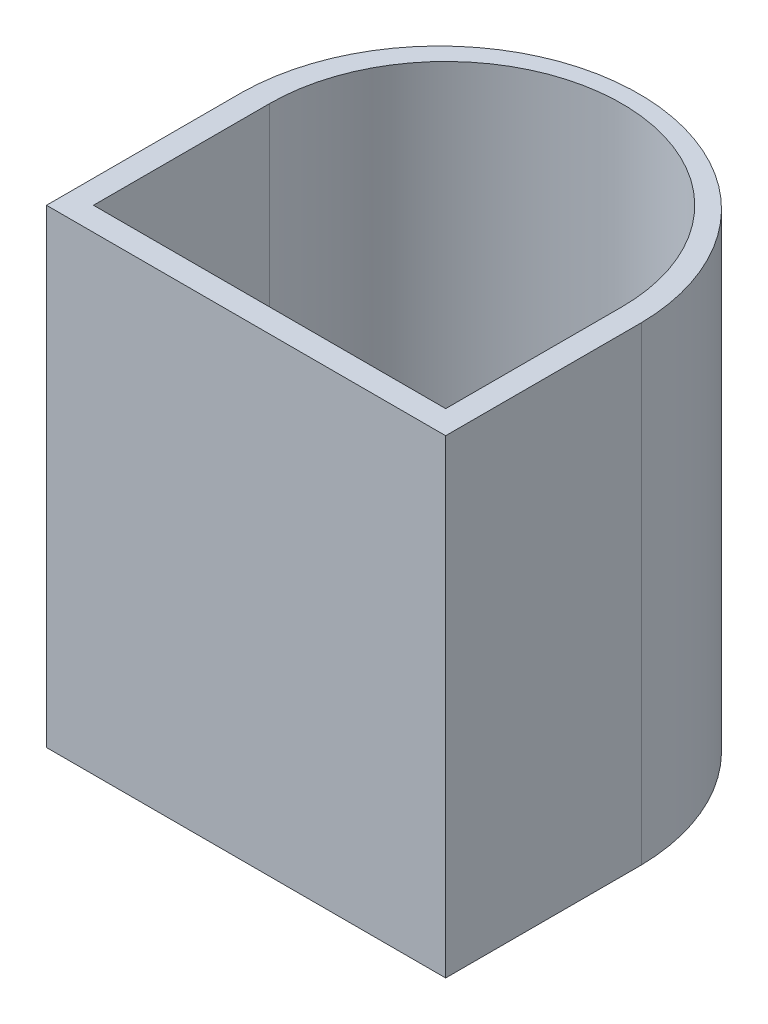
from build123d import *

# Parameters (mm, degrees)
BOSS_EXTRUDE1_DEPTH      = 38
BOSS_EXTRUDE1_DEPTH_BACK = 2
CUT_EXTRUDE1_DEPTH       = 38
SKETCH4_W                = 18
SKETCH4_H                = 12
CUT_EXTRUDE3_DEPTH       = 2


with BuildPart() as part:
    # Sketch2 → Boss-Extrude1 (new, two sides: drawn at the far end of the back side and taken through both)
    # profile 1 of 2: a face of its own
    with BuildSketch(Plane(origin=(0, 0, 0), x_dir=(1, 0, 0), z_dir=(0, 1, 0)).offset(-BOSS_EXTRUDE1_DEPTH_BACK)):
        with BuildLine():
            ThreePointArc((-2, 14.67707178), (14.998515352, 31.452403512), (31.997030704, 14.67707178))
            Line((31.997030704, 14.67707178), (31.997030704, -2))
            Line((31.997030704, -2), (-2, -2))
            Line((-2, -2), (-2, 14.67707178))
        make_face()
        with BuildLine():
            Line((0, 0), (0, 15))
            ThreePointArc((0, 15), (15, 30), (30, 15))
            Line((30, 15), (30, 0))
            Line((30, 0), (0, 0))
        make_face(mode=Mode.SUBTRACT)
    # profile 2 of 2: a face of its own
    with BuildSketch(Plane(origin=(0, 0, 0), x_dir=(1, 0, 0), z_dir=(0, 1, 0)).offset(-BOSS_EXTRUDE1_DEPTH_BACK)):
        with BuildLine():
            ThreePointArc((0, 15), (15, 30), (30, 15))
            Line((30, 15), (30, 0))
            Line((30, 0), (0, 0))
            Line((0, 0), (0, 15))
        make_face()
    extrude(amount=BOSS_EXTRUDE1_DEPTH + BOSS_EXTRUDE1_DEPTH_BACK)

    # Sketch2_4 → Cut-Extrude1 (cut)
    with BuildSketch(Plane(origin=(0, 0, 0), x_dir=(1, 0, 0), z_dir=(0, 1, 0))):
        with BuildLine():
            ThreePointArc((0, 15), (15, 30), (30, 15))
            Line((30, 15), (30, 0))
            Line((30, 0), (0, 0))
            Line((0, 0), (0, 15))
        make_face()
    extrude(amount=CUT_EXTRUDE1_DEPTH, mode=Mode.SUBTRACT)

    # Sketch4 → Cut-Extrude3 (cut)
    with BuildSketch(Plane(origin=(0, 0, 0), x_dir=(1, 0, 0), z_dir=(0, 1, 0))):
        with Locations((15, 15)):
            Rectangle(SKETCH4_W, SKETCH4_H)
    extrude(amount=-CUT_EXTRUDE3_DEPTH, mode=Mode.SUBTRACT)


solid = part.part
